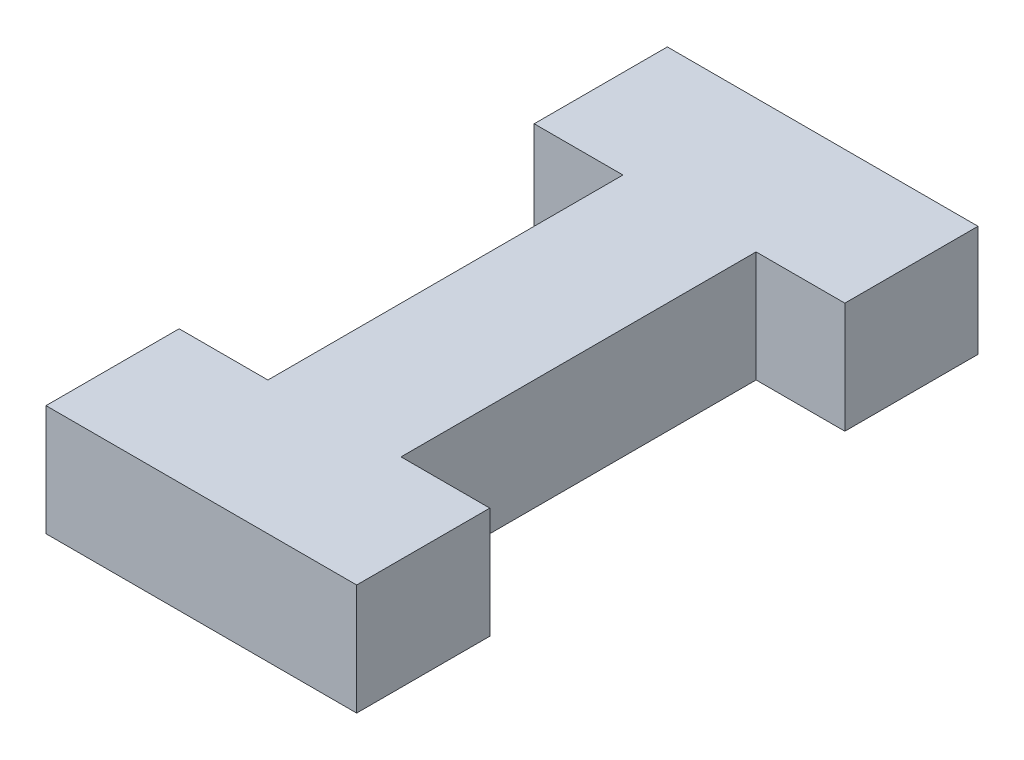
from build123d import *

# Parameters (mm, degrees)
BOSS_EXTRUDE1_DEPTH = 2.5


with BuildPart() as part:
    # Sketch1 → Boss-Extrude1 (new body)
    with BuildSketch(Plane(origin=(0, 0, 0), x_dir=(1, 0, 0), z_dir=(0, 1, 0))):
        Polygon((3.5, 7), (-3.5, 7), (-3.5, 4), (-1.5, 4), (-1.5, -4), (-3.5, -4), (-3.5, -7), (3.5, -7), (3.5, -4), (1.5, -4), (1.5, 4), (3.5, 4), align=None)
    extrude(amount=BOSS_EXTRUDE1_DEPTH)


solid = part.part
